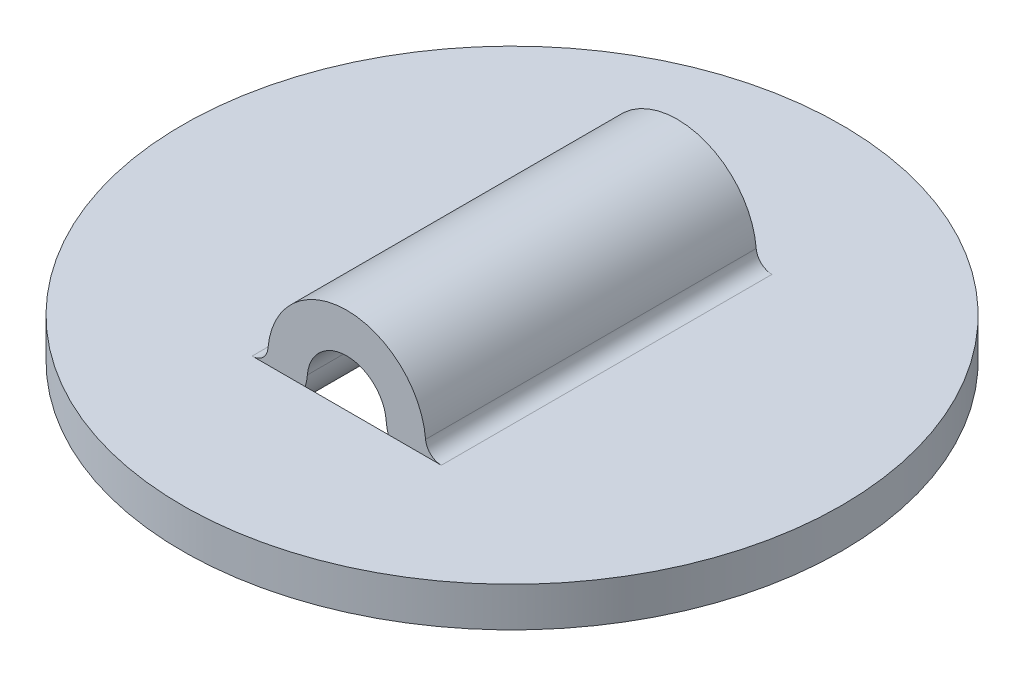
ISO-10303-21;
HEADER;
FILE_DESCRIPTION(('STEP AP214'),'2;1');
FILE_NAME('part.step','',(''),(''),'','','');
FILE_SCHEMA(('AUTOMOTIVE_DESIGN { 1 0 10303 214 1 1 1 1 }'));
ENDSEC;
DATA;
#1=APPLICATION_CONTEXT('core data for automotive mechanical design processes');
#2=APPLICATION_PROTOCOL_DEFINITION('international standard','automotive_design',2000,#1);
#3=PRODUCT_CONTEXT('',#1,'mechanical');
#4=PRODUCT('Part','Part','',(#3));
#5=PRODUCT_RELATED_PRODUCT_CATEGORY('part','',(#4));
#6=PRODUCT_DEFINITION_FORMATION('','',#4);
#7=PRODUCT_DEFINITION_CONTEXT('part definition',#1,'design');
#8=PRODUCT_DEFINITION('design','',#6,#7);
#9=PRODUCT_DEFINITION_SHAPE('','',#8);
#10=(LENGTH_UNIT() NAMED_UNIT(*) SI_UNIT(.MILLI.,.METRE.));
#11=(NAMED_UNIT(*) PLANE_ANGLE_UNIT() SI_UNIT($,.RADIAN.));
#12=(NAMED_UNIT(*) SI_UNIT($,.STERADIAN.) SOLID_ANGLE_UNIT());
#13=UNCERTAINTY_MEASURE_WITH_UNIT(LENGTH_MEASURE(1.E-05),#10,'distance_accuracy_value','');
#14=(GEOMETRIC_REPRESENTATION_CONTEXT(3) GLOBAL_UNCERTAINTY_ASSIGNED_CONTEXT((#13)) GLOBAL_UNIT_ASSIGNED_CONTEXT((#10,
#11,#12)) REPRESENTATION_CONTEXT('',''));
#15=CARTESIAN_POINT('',(0.,0.,0.));
#16=DIRECTION('',(0.,0.,1.));
#17=DIRECTION('',(1.,0.,0.));
#18=AXIS2_PLACEMENT_3D('',#15,#16,#17);
#19=CARTESIAN_POINT('',(0.,0.380999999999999,15.9258));
#20=DIRECTION('',(0.,0.,-1.));
#21=DIRECTION('',(-1.,0.,0.));
#22=AXIS2_PLACEMENT_3D('',#19,#20,#21);
#23=CYLINDRICAL_SURFACE('',#22,1.905);
#24=CARTESIAN_POINT('',(0.,0.380999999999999,15.9258));
#25=DIRECTION('',(0.,0.,-1.));
#26=DIRECTION('',(-1.,0.,0.));
#27=AXIS2_PLACEMENT_3D('',#24,#25,#26);
#28=CIRCLE('',#27,1.905);
#29=CARTESIAN_POINT('',(1.89837389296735,0.539750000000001,15.9258));
#30=VERTEX_POINT('',#29);
#31=CARTESIAN_POINT('',(-1.89837389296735,0.53975,15.9258));
#32=VERTEX_POINT('',#31);
#33=EDGE_CURVE('E101',#30,#32,#28,.F.);
#34=ORIENTED_EDGE('',*,*,#33,.T.);
#35=DIRECTION('',(0.,0.,-1.));
#36=VECTOR('',#35,1.);
#37=CARTESIAN_POINT('',(-1.89837389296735,0.53975,15.9258));
#38=LINE('',#37,#36);
#39=CARTESIAN_POINT('',(-1.89837389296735,0.53975,0.));
#40=VERTEX_POINT('',#39);
#41=EDGE_CURVE('E95',#40,#32,#38,.F.);
#42=ORIENTED_EDGE('',*,*,#41,.F.);
#43=CARTESIAN_POINT('',(0.,0.380999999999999,0.));
#44=DIRECTION('',(0.,0.,-1.));
#45=DIRECTION('',(-1.,0.,0.));
#46=AXIS2_PLACEMENT_3D('',#43,#44,#45);
#47=CIRCLE('',#46,1.905);
#48=CARTESIAN_POINT('',(1.89837389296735,0.539750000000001,0.));
#49=VERTEX_POINT('',#48);
#50=EDGE_CURVE('E155',#49,#40,#47,.F.);
#51=ORIENTED_EDGE('',*,*,#50,.F.);
#52=DIRECTION('',(0.,0.,-1.));
#53=VECTOR('',#52,1.);
#54=CARTESIAN_POINT('',(1.89837389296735,0.539750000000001,15.9258));
#55=LINE('',#54,#53);
#56=EDGE_CURVE('E128',#30,#49,#55,.T.);
#57=ORIENTED_EDGE('',*,*,#56,.F.);
#58=EDGE_LOOP('',(#34,#42,#51,#57));
#59=FACE_BOUND('',#58,.T.);
#60=ADVANCED_FACE('F18',(#59),#23,.F.);
#61=CARTESIAN_POINT('',(0.,0.380999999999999,15.9258));
#62=DIRECTION('',(0.,0.,-1.));
#63=DIRECTION('',(-1.,0.,0.));
#64=AXIS2_PLACEMENT_3D('',#61,#62,#63);
#65=CYLINDRICAL_SURFACE('',#64,3.81);
#66=CARTESIAN_POINT('',(0.,0.380999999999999,0.));
#67=DIRECTION('',(0.,0.,-1.));
#68=DIRECTION('',(-1.,0.,0.));
#69=AXIS2_PLACEMENT_3D('',#66,#67,#68);
#70=CIRCLE('',#69,3.81);
#71=CARTESIAN_POINT('',(-3.79674778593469,0.6985,0.));
#72=VERTEX_POINT('',#71);
#73=CARTESIAN_POINT('',(3.79674778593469,0.6985,0.));
#74=VERTEX_POINT('',#73);
#75=EDGE_CURVE('E146',#72,#74,#70,.T.);
#76=ORIENTED_EDGE('',*,*,#75,.F.);
#77=DIRECTION('',(0.,0.,-1.));
#78=VECTOR('',#77,1.);
#79=CARTESIAN_POINT('',(-3.79674778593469,0.6985,15.9258));
#80=LINE('',#79,#78);
#81=CARTESIAN_POINT('',(-3.79674778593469,0.6985,15.9258));
#82=VERTEX_POINT('',#81);
#83=EDGE_CURVE('E89',#72,#82,#80,.F.);
#84=ORIENTED_EDGE('',*,*,#83,.T.);
#85=CARTESIAN_POINT('',(0.,0.380999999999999,15.9258));
#86=DIRECTION('',(0.,0.,-1.));
#87=DIRECTION('',(-1.,0.,0.));
#88=AXIS2_PLACEMENT_3D('',#85,#86,#87);
#89=CIRCLE('',#88,3.81);
#90=CARTESIAN_POINT('',(3.79674778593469,0.6985,15.9258));
#91=VERTEX_POINT('',#90);
#92=EDGE_CURVE('E163',#82,#91,#89,.T.);
#93=ORIENTED_EDGE('',*,*,#92,.T.);
#94=DIRECTION('',(0.,0.,-1.));
#95=VECTOR('',#94,1.);
#96=CARTESIAN_POINT('',(3.79674778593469,0.6985,15.9258));
#97=LINE('',#96,#95);
#98=EDGE_CURVE('E134',#91,#74,#97,.T.);
#99=ORIENTED_EDGE('',*,*,#98,.T.);
#100=EDGE_LOOP('',(#76,#84,#93,#99));
#101=FACE_BOUND('',#100,.T.);
#102=ADVANCED_FACE('F206',(#101),#65,.T.);
#103=CARTESIAN_POINT('',(-4.55609734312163,0.762,15.9258));
#104=DIRECTION('',(0.,0.,-1.));
#105=DIRECTION('',(-1.,0.,0.));
#106=AXIS2_PLACEMENT_3D('',#103,#104,#105);
#107=CYLINDRICAL_SURFACE('',#106,2.667);
#108=CARTESIAN_POINT('',(-4.55609734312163,0.762,0.));
#109=DIRECTION('',(0.,0.,-1.));
#110=DIRECTION('',(-1.,0.,0.));
#111=AXIS2_PLACEMENT_3D('',#108,#109,#110);
#112=CIRCLE('',#111,2.667);
#113=CARTESIAN_POINT('',(-2.00027164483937,0.,0.));
#114=VERTEX_POINT('',#113);
#115=EDGE_CURVE('E152',#40,#114,#112,.T.);
#116=ORIENTED_EDGE('',*,*,#115,.F.);
#117=ORIENTED_EDGE('',*,*,#41,.T.);
#118=CARTESIAN_POINT('',(-4.55609734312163,0.762,15.9258));
#119=DIRECTION('',(0.,0.,-1.));
#120=DIRECTION('',(-1.,0.,0.));
#121=AXIS2_PLACEMENT_3D('',#118,#119,#120);
#122=CIRCLE('',#121,2.667);
#123=CARTESIAN_POINT('',(-2.00027164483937,0.,15.9258));
#124=VERTEX_POINT('',#123);
#125=EDGE_CURVE('E91',#32,#124,#122,.T.);
#126=ORIENTED_EDGE('',*,*,#125,.T.);
#127=CARTESIAN_POINT('',(-4.55609734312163,0.762,15.9258));
#128=DIRECTION('',(0.,0.,-1.));
#129=DIRECTION('',(-1.,0.,0.));
#130=AXIS2_PLACEMENT_3D('',#127,#128,#129);
#131=CIRCLE('',#130,2.667);
#132=CARTESIAN_POINT('',(-4.55609734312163,-1.905,15.9258));
#133=VERTEX_POINT('',#132);
#134=EDGE_CURVE('E79',#124,#133,#131,.T.);
#135=ORIENTED_EDGE('',*,*,#134,.T.);
#136=DIRECTION('',(0.,0.,1.));
#137=VECTOR('',#136,1.);
#138=CARTESIAN_POINT('',(-4.55609734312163,-1.905,15.9258));
#139=LINE('',#138,#137);
#140=CARTESIAN_POINT('',(-4.55609734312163,-1.905,0.));
#141=VERTEX_POINT('',#140);
#142=EDGE_CURVE('E129',#133,#141,#139,.F.);
#143=ORIENTED_EDGE('',*,*,#142,.T.);
#144=CARTESIAN_POINT('',(-4.55609734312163,0.762,0.));
#145=DIRECTION('',(0.,0.,-1.));
#146=DIRECTION('',(-1.,0.,0.));
#147=AXIS2_PLACEMENT_3D('',#144,#145,#146);
#148=CIRCLE('',#147,2.667);
#149=EDGE_CURVE('E143',#114,#141,#148,.T.);
#150=ORIENTED_EDGE('',*,*,#149,.F.);
#151=EDGE_LOOP('',(#116,#117,#126,#135,#143,#150));
#152=FACE_BOUND('',#151,.T.);
#153=ADVANCED_FACE('F93',(#152),#107,.T.);
#154=CARTESIAN_POINT('',(-15.875,-1.905,15.9258));
#155=DIRECTION('',(0.,1.,0.));
#156=DIRECTION('',(0.,0.,1.));
#157=AXIS2_PLACEMENT_3D('',#154,#155,#156);
#158=PLANE('',#157);
#159=ORIENTED_EDGE('',*,*,#142,.F.);
#160=DIRECTION('',(1.,0.,0.));
#161=VECTOR('',#160,1.);
#162=CARTESIAN_POINT('',(4.55609734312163,-1.905,15.9258));
#163=LINE('',#162,#161);
#164=CARTESIAN_POINT('',(4.55609734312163,-1.905,15.9258));
#165=VERTEX_POINT('',#164);
#166=EDGE_CURVE('E86',#133,#165,#163,.T.);
#167=ORIENTED_EDGE('',*,*,#166,.T.);
#168=DIRECTION('',(0.,0.,-1.));
#169=VECTOR('',#168,1.);
#170=CARTESIAN_POINT('',(4.55609734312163,-1.905,15.9258));
#171=LINE('',#170,#169);
#172=CARTESIAN_POINT('',(4.55609734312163,-1.905,0.));
#173=VERTEX_POINT('',#172);
#174=EDGE_CURVE('E126',#173,#165,#171,.F.);
#175=ORIENTED_EDGE('',*,*,#174,.F.);
#176=DIRECTION('',(1.,0.,0.));
#177=VECTOR('',#176,1.);
#178=CARTESIAN_POINT('',(4.55609734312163,-1.905,0.));
#179=LINE('',#178,#177);
#180=EDGE_CURVE('E142',#141,#173,#179,.T.);
#181=ORIENTED_EDGE('',*,*,#180,.F.);
#182=EDGE_LOOP('',(#159,#167,#175,#181));
#183=FACE_BOUND('',#182,.T.);
#184=CARTESIAN_POINT('',(0.,-1.905,7.9629));
#185=DIRECTION('',(0.,-1.,0.));
#186=DIRECTION('',(1.,0.,0.));
#187=AXIS2_PLACEMENT_3D('',#184,#185,#186);
#188=CIRCLE('',#187,15.875);
#189=CARTESIAN_POINT('',(15.875,-1.905,7.9629));
#190=VERTEX_POINT('',#189);
#191=EDGE_CURVE('E21',#190,#190,#188,.F.);
#192=ORIENTED_EDGE('',*,*,#191,.F.);
#193=EDGE_LOOP('',(#192));
#194=FACE_BOUND('',#193,.T.);
#195=ADVANCED_FACE('F176',(#183,#194),#158,.F.);
#196=CARTESIAN_POINT('',(4.55609734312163,0.762000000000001,15.9258));
#197=DIRECTION('',(0.,0.,-1.));
#198=DIRECTION('',(-1.,0.,0.));
#199=AXIS2_PLACEMENT_3D('',#196,#197,#198);
#200=CYLINDRICAL_SURFACE('',#199,2.667);
#201=CARTESIAN_POINT('',(4.55609734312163,0.762000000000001,15.9258));
#202=DIRECTION('',(0.,0.,-1.));
#203=DIRECTION('',(-1.,0.,0.));
#204=AXIS2_PLACEMENT_3D('',#201,#202,#203);
#205=CIRCLE('',#204,2.667);
#206=CARTESIAN_POINT('',(2.00027164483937,0.,15.9258));
#207=VERTEX_POINT('',#206);
#208=EDGE_CURVE('E167',#207,#30,#205,.T.);
#209=ORIENTED_EDGE('',*,*,#208,.T.);
#210=ORIENTED_EDGE('',*,*,#56,.T.);
#211=CARTESIAN_POINT('',(4.55609734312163,0.762000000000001,0.));
#212=DIRECTION('',(0.,0.,-1.));
#213=DIRECTION('',(-1.,0.,0.));
#214=AXIS2_PLACEMENT_3D('',#211,#212,#213);
#215=CIRCLE('',#214,2.667);
#216=CARTESIAN_POINT('',(2.00027164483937,0.,0.));
#217=VERTEX_POINT('',#216);
#218=EDGE_CURVE('E158',#217,#49,#215,.T.);
#219=ORIENTED_EDGE('',*,*,#218,.F.);
#220=CARTESIAN_POINT('',(4.55609734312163,0.762000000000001,0.));
#221=DIRECTION('',(0.,0.,-1.));
#222=DIRECTION('',(-1.,0.,0.));
#223=AXIS2_PLACEMENT_3D('',#220,#221,#222);
#224=CIRCLE('',#223,2.667);
#225=EDGE_CURVE('E35',#173,#217,#224,.T.);
#226=ORIENTED_EDGE('',*,*,#225,.F.);
#227=ORIENTED_EDGE('',*,*,#174,.T.);
#228=CARTESIAN_POINT('',(4.55609734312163,0.762000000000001,15.9258));
#229=DIRECTION('',(0.,0.,-1.));
#230=DIRECTION('',(-1.,0.,0.));
#231=AXIS2_PLACEMENT_3D('',#228,#229,#230);
#232=CIRCLE('',#231,2.667);
#233=EDGE_CURVE('E170',#165,#207,#232,.T.);
#234=ORIENTED_EDGE('',*,*,#233,.T.);
#235=EDGE_LOOP('',(#209,#210,#219,#226,#227,#234));
#236=FACE_BOUND('',#235,.T.);
#237=ADVANCED_FACE('F203',(#236),#200,.T.);
#238=CARTESIAN_POINT('',(0.,0.,7.9629));
#239=DIRECTION('',(0.,-1.,0.));
#240=DIRECTION('',(1.,0.,0.));
#241=AXIS2_PLACEMENT_3D('',#238,#239,#240);
#242=CYLINDRICAL_SURFACE('',#241,15.875);
#243=ORIENTED_EDGE('',*,*,#191,.T.);
#244=EDGE_LOOP('',(#243));
#245=FACE_BOUND('',#244,.T.);
#246=CARTESIAN_POINT('',(0.,0.,7.9629));
#247=DIRECTION('',(0.,-1.,0.));
#248=DIRECTION('',(1.,0.,0.));
#249=AXIS2_PLACEMENT_3D('',#246,#247,#248);
#250=CIRCLE('',#249,15.875);
#251=CARTESIAN_POINT('',(15.875,0.,7.9629));
#252=VERTEX_POINT('',#251);
#253=EDGE_CURVE('E138',#252,#252,#250,.T.);
#254=ORIENTED_EDGE('',*,*,#253,.T.);
#255=EDGE_LOOP('',(#254));
#256=FACE_BOUND('',#255,.T.);
#257=ADVANCED_FACE('F232',(#245,#256),#242,.T.);
#258=CARTESIAN_POINT('',(-4.55609734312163,0.762,15.9258));
#259=DIRECTION('',(0.,0.,-1.));
#260=DIRECTION('',(-1.,0.,0.));
#261=AXIS2_PLACEMENT_3D('',#258,#259,#260);
#262=CYLINDRICAL_SURFACE('',#261,0.762000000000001);
#263=CARTESIAN_POINT('',(-4.55609734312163,0.762,15.9258));
#264=DIRECTION('',(0.,0.,-1.));
#265=DIRECTION('',(-1.,0.,0.));
#266=AXIS2_PLACEMENT_3D('',#263,#264,#265);
#267=CIRCLE('',#266,0.762000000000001);
#268=CARTESIAN_POINT('',(-4.55609734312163,0.,15.9258));
#269=VERTEX_POINT('',#268);
#270=EDGE_CURVE('E100',#269,#82,#267,.F.);
#271=ORIENTED_EDGE('',*,*,#270,.T.);
#272=ORIENTED_EDGE('',*,*,#83,.F.);
#273=CARTESIAN_POINT('',(-4.55609734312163,0.762,0.));
#274=DIRECTION('',(0.,0.,-1.));
#275=DIRECTION('',(-1.,0.,0.));
#276=AXIS2_PLACEMENT_3D('',#273,#274,#275);
#277=CIRCLE('',#276,0.762000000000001);
#278=CARTESIAN_POINT('',(-4.55609734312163,0.,0.));
#279=VERTEX_POINT('',#278);
#280=EDGE_CURVE('E149',#279,#72,#277,.F.);
#281=ORIENTED_EDGE('',*,*,#280,.F.);
#282=DIRECTION('',(0.,0.,1.));
#283=VECTOR('',#282,1.);
#284=CARTESIAN_POINT('',(-4.55609734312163,0.,15.9258));
#285=LINE('',#284,#283);
#286=EDGE_CURVE('E120',#279,#269,#285,.T.);
#287=ORIENTED_EDGE('',*,*,#286,.T.);
#288=EDGE_LOOP('',(#271,#272,#281,#287));
#289=FACE_BOUND('',#288,.T.);
#290=ADVANCED_FACE('F229',(#289),#262,.F.);
#291=CARTESIAN_POINT('',(4.55609734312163,0.762000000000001,15.9258));
#292=DIRECTION('',(0.,0.,1.));
#293=DIRECTION('',(1.,0.,0.));
#294=AXIS2_PLACEMENT_3D('',#291,#292,#293);
#295=PLANE('',#294);
#296=ORIENTED_EDGE('',*,*,#166,.F.);
#297=ORIENTED_EDGE('',*,*,#134,.F.);
#298=DIRECTION('',(1.,0.,0.));
#299=VECTOR('',#298,1.);
#300=CARTESIAN_POINT('',(4.55609734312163,0.,15.9258));
#301=LINE('',#300,#299);
#302=EDGE_CURVE('E84',#124,#207,#301,.T.);
#303=ORIENTED_EDGE('',*,*,#302,.T.);
#304=ORIENTED_EDGE('',*,*,#233,.F.);
#305=EDGE_LOOP('',(#296,#297,#303,#304));
#306=FACE_BOUND('',#305,.T.);
#307=ADVANCED_FACE('F81',(#306),#295,.F.);
#308=CARTESIAN_POINT('',(-4.55609734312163,0.762,15.9258));
#309=DIRECTION('',(0.,0.,-1.));
#310=DIRECTION('',(-1.,0.,0.));
#311=AXIS2_PLACEMENT_3D('',#308,#309,#310);
#312=PLANE('',#311);
#313=CARTESIAN_POINT('',(4.55609734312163,0.762000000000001,15.9258));
#314=DIRECTION('',(0.,0.,-1.));
#315=DIRECTION('',(-1.,0.,0.));
#316=AXIS2_PLACEMENT_3D('',#313,#314,#315);
#317=CIRCLE('',#316,0.762000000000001);
#318=CARTESIAN_POINT('',(4.55609734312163,0.,15.9258));
#319=VERTEX_POINT('',#318);
#320=EDGE_CURVE('E137',#319,#91,#317,.T.);
#321=ORIENTED_EDGE('',*,*,#320,.T.);
#322=ORIENTED_EDGE('',*,*,#92,.F.);
#323=ORIENTED_EDGE('',*,*,#270,.F.);
#324=DIRECTION('',(1.,0.,0.));
#325=VECTOR('',#324,1.);
#326=CARTESIAN_POINT('',(4.55609734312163,0.,15.9258));
#327=LINE('',#326,#325);
#328=EDGE_CURVE('E110',#269,#124,#327,.T.);
#329=ORIENTED_EDGE('',*,*,#328,.T.);
#330=ORIENTED_EDGE('',*,*,#125,.F.);
#331=ORIENTED_EDGE('',*,*,#33,.F.);
#332=ORIENTED_EDGE('',*,*,#208,.F.);
#333=DIRECTION('',(1.,0.,0.));
#334=VECTOR('',#333,1.);
#335=CARTESIAN_POINT('',(4.55609734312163,0.,15.9258));
#336=LINE('',#335,#334);
#337=EDGE_CURVE('E114',#207,#319,#336,.T.);
#338=ORIENTED_EDGE('',*,*,#337,.T.);
#339=EDGE_LOOP('',(#321,#322,#323,#329,#330,#331,#332,#338));
#340=FACE_BOUND('',#339,.T.);
#341=ADVANCED_FACE('F117',(#340),#312,.F.);
#342=CARTESIAN_POINT('',(4.55609734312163,0.762000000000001,15.9258));
#343=DIRECTION('',(0.,0.,-1.));
#344=DIRECTION('',(-1.,0.,0.));
#345=AXIS2_PLACEMENT_3D('',#342,#343,#344);
#346=CYLINDRICAL_SURFACE('',#345,0.762000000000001);
#347=ORIENTED_EDGE('',*,*,#320,.F.);
#348=DIRECTION('',(0.,0.,1.));
#349=VECTOR('',#348,1.);
#350=CARTESIAN_POINT('',(4.55609734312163,0.,15.9258));
#351=LINE('',#350,#349);
#352=CARTESIAN_POINT('',(4.55609734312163,0.,0.));
#353=VERTEX_POINT('',#352);
#354=EDGE_CURVE('E200',#319,#353,#351,.F.);
#355=ORIENTED_EDGE('',*,*,#354,.T.);
#356=CARTESIAN_POINT('',(4.55609734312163,0.762000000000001,0.));
#357=DIRECTION('',(0.,0.,-1.));
#358=DIRECTION('',(-1.,0.,0.));
#359=AXIS2_PLACEMENT_3D('',#356,#357,#358);
#360=CIRCLE('',#359,0.762000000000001);
#361=EDGE_CURVE('E136',#74,#353,#360,.F.);
#362=ORIENTED_EDGE('',*,*,#361,.F.);
#363=ORIENTED_EDGE('',*,*,#98,.F.);
#364=EDGE_LOOP('',(#347,#355,#362,#363));
#365=FACE_BOUND('',#364,.T.);
#366=ADVANCED_FACE('F221',(#365),#346,.F.);
#367=CARTESIAN_POINT('',(-4.55609734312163,0.762,0.));
#368=DIRECTION('',(0.,0.,-1.));
#369=DIRECTION('',(-1.,0.,0.));
#370=AXIS2_PLACEMENT_3D('',#367,#368,#369);
#371=PLANE('',#370);
#372=ORIENTED_EDGE('',*,*,#280,.T.);
#373=ORIENTED_EDGE('',*,*,#75,.T.);
#374=ORIENTED_EDGE('',*,*,#361,.T.);
#375=DIRECTION('',(1.,0.,0.));
#376=VECTOR('',#375,1.);
#377=CARTESIAN_POINT('',(4.55609734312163,0.,0.));
#378=LINE('',#377,#376);
#379=EDGE_CURVE('E27',#353,#217,#378,.F.);
#380=ORIENTED_EDGE('',*,*,#379,.T.);
#381=ORIENTED_EDGE('',*,*,#218,.T.);
#382=ORIENTED_EDGE('',*,*,#50,.T.);
#383=ORIENTED_EDGE('',*,*,#115,.T.);
#384=DIRECTION('',(1.,0.,0.));
#385=VECTOR('',#384,1.);
#386=CARTESIAN_POINT('',(4.55609734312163,0.,0.));
#387=LINE('',#386,#385);
#388=EDGE_CURVE('E122',#114,#279,#387,.F.);
#389=ORIENTED_EDGE('',*,*,#388,.T.);
#390=EDGE_LOOP('',(#372,#373,#374,#380,#381,#382,#383,#389));
#391=FACE_BOUND('',#390,.T.);
#392=ADVANCED_FACE('F193',(#391),#371,.T.);
#393=CARTESIAN_POINT('',(4.55609734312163,0.762000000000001,0.));
#394=DIRECTION('',(0.,0.,1.));
#395=DIRECTION('',(1.,0.,0.));
#396=AXIS2_PLACEMENT_3D('',#393,#394,#395);
#397=PLANE('',#396);
#398=ORIENTED_EDGE('',*,*,#180,.T.);
#399=ORIENTED_EDGE('',*,*,#225,.T.);
#400=DIRECTION('',(1.,0.,0.));
#401=VECTOR('',#400,1.);
#402=CARTESIAN_POINT('',(4.55609734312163,0.,0.));
#403=LINE('',#402,#401);
#404=EDGE_CURVE('E11',#217,#114,#403,.F.);
#405=ORIENTED_EDGE('',*,*,#404,.T.);
#406=ORIENTED_EDGE('',*,*,#149,.T.);
#407=EDGE_LOOP('',(#398,#399,#405,#406));
#408=FACE_BOUND('',#407,.T.);
#409=ADVANCED_FACE('F212',(#408),#397,.T.);
#410=CARTESIAN_POINT('',(4.55609734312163,0.,15.9258));
#411=DIRECTION('',(0.,-1.,0.));
#412=DIRECTION('',(1.,0.,0.));
#413=AXIS2_PLACEMENT_3D('',#410,#411,#412);
#414=PLANE('',#413);
#415=ORIENTED_EDGE('',*,*,#379,.F.);
#416=ORIENTED_EDGE('',*,*,#354,.F.);
#417=ORIENTED_EDGE('',*,*,#337,.F.);
#418=ORIENTED_EDGE('',*,*,#302,.F.);
#419=ORIENTED_EDGE('',*,*,#328,.F.);
#420=ORIENTED_EDGE('',*,*,#286,.F.);
#421=ORIENTED_EDGE('',*,*,#388,.F.);
#422=ORIENTED_EDGE('',*,*,#404,.F.);
#423=EDGE_LOOP('',(#415,#416,#417,#418,#419,#420,#421,#422));
#424=FACE_BOUND('',#423,.T.);
#425=ORIENTED_EDGE('',*,*,#253,.F.);
#426=EDGE_LOOP('',(#425));
#427=FACE_BOUND('',#426,.T.);
#428=ADVANCED_FACE('F107',(#424,#427),#414,.F.);
#429=CLOSED_SHELL('',(#60,#102,#153,#195,#237,#257,#290,#307,#341,#366,#392,#409,#428));
#430=MANIFOLD_SOLID_BREP('B1',#429);
#431=ADVANCED_BREP_SHAPE_REPRESENTATION('',(#18,#430),#14);
#432=SHAPE_DEFINITION_REPRESENTATION(#9,#431);
ENDSEC;
END-ISO-10303-21;
